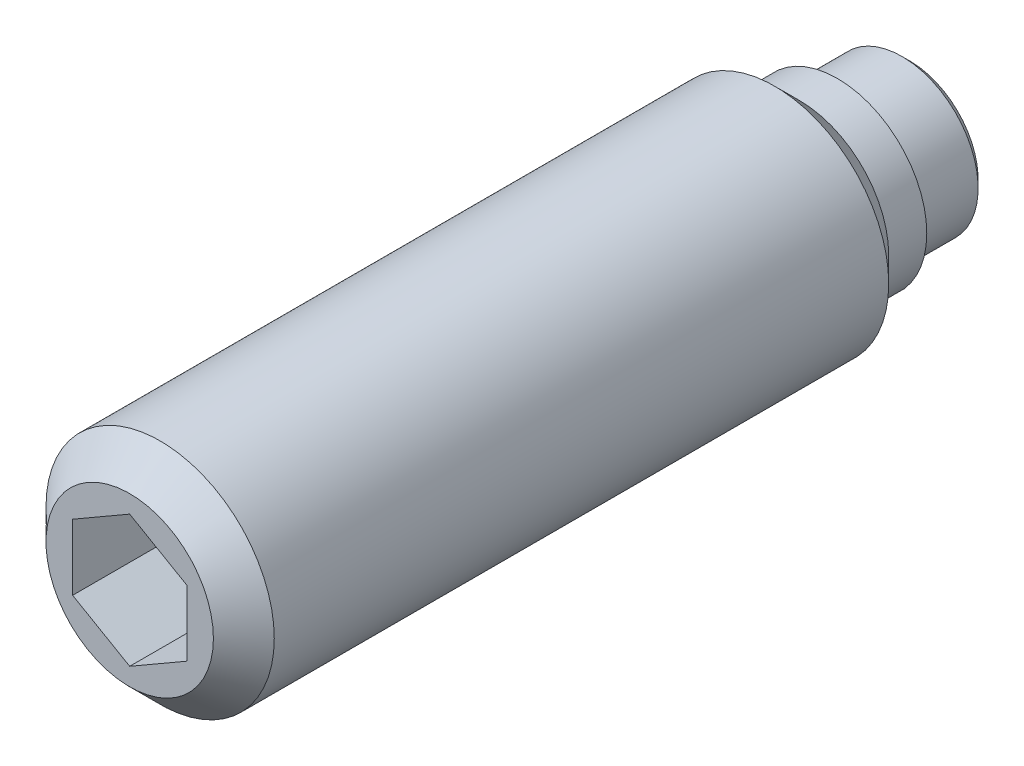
ISO-10303-21;
HEADER;
FILE_DESCRIPTION(('STEP AP214'),'2;1');
FILE_NAME('part.step','',(''),(''),'','','');
FILE_SCHEMA(('AUTOMOTIVE_DESIGN { 1 0 10303 214 1 1 1 1 }'));
ENDSEC;
DATA;
#1=APPLICATION_CONTEXT('core data for automotive mechanical design processes');
#2=APPLICATION_PROTOCOL_DEFINITION('international standard','automotive_design',2000,#1);
#3=PRODUCT_CONTEXT('',#1,'mechanical');
#4=PRODUCT('Part','Part','',(#3));
#5=PRODUCT_RELATED_PRODUCT_CATEGORY('part','',(#4));
#6=PRODUCT_DEFINITION_FORMATION('','',#4);
#7=PRODUCT_DEFINITION_CONTEXT('part definition',#1,'design');
#8=PRODUCT_DEFINITION('design','',#6,#7);
#9=PRODUCT_DEFINITION_SHAPE('','',#8);
#10=(LENGTH_UNIT() NAMED_UNIT(*) SI_UNIT(.MILLI.,.METRE.));
#11=(NAMED_UNIT(*) PLANE_ANGLE_UNIT() SI_UNIT($,.RADIAN.));
#12=(NAMED_UNIT(*) SI_UNIT($,.STERADIAN.) SOLID_ANGLE_UNIT());
#13=UNCERTAINTY_MEASURE_WITH_UNIT(LENGTH_MEASURE(1.E-05),#10,'distance_accuracy_value','');
#14=(GEOMETRIC_REPRESENTATION_CONTEXT(3) GLOBAL_UNCERTAINTY_ASSIGNED_CONTEXT((#13)) GLOBAL_UNIT_ASSIGNED_CONTEXT((#10,
#11,#12)) REPRESENTATION_CONTEXT('',''));
#15=CARTESIAN_POINT('',(0.,0.,0.));
#16=DIRECTION('',(0.,0.,1.));
#17=DIRECTION('',(1.,0.,0.));
#18=AXIS2_PLACEMENT_3D('',#15,#16,#17);
#19=CARTESIAN_POINT('',(0.,0.,1.9));
#20=DIRECTION('',(0.,0.,-1.));
#21=DIRECTION('',(-1.,0.,0.));
#22=AXIS2_PLACEMENT_3D('',#19,#20,#21);
#23=CYLINDRICAL_SURFACE('',#22,3.);
#24=CARTESIAN_POINT('',(0.,0.,19.7));
#25=DIRECTION('',(0.,0.,1.));
#26=DIRECTION('',(1.,0.,0.));
#27=AXIS2_PLACEMENT_3D('',#24,#25,#26);
#28=CIRCLE('',#27,3.);
#29=CARTESIAN_POINT('',(3.,0.,19.7));
#30=VERTEX_POINT('',#29);
#31=EDGE_CURVE('E9',#30,#30,#28,.F.);
#32=ORIENTED_EDGE('',*,*,#31,.T.);
#33=EDGE_LOOP('',(#32));
#34=FACE_BOUND('',#33,.T.);
#35=CARTESIAN_POINT('',(0.,0.,3.55));
#36=DIRECTION('',(0.,0.,-1.));
#37=DIRECTION('',(-1.,0.,0.));
#38=AXIS2_PLACEMENT_3D('',#35,#36,#37);
#39=CIRCLE('',#38,3.);
#40=CARTESIAN_POINT('',(-3.,0.,3.55));
#41=VERTEX_POINT('',#40);
#42=EDGE_CURVE('E74',#41,#41,#39,.T.);
#43=ORIENTED_EDGE('',*,*,#42,.F.);
#44=EDGE_LOOP('',(#43));
#45=FACE_BOUND('',#44,.T.);
#46=ADVANCED_FACE('F14',(#34,#45),#23,.T.);
#47=CARTESIAN_POINT('',(0.,0.,3.55));
#48=DIRECTION('',(0.,0.,1.));
#49=DIRECTION('',(1.,0.,0.));
#50=AXIS2_PLACEMENT_3D('',#47,#48,#49);
#51=CONICAL_SURFACE('',#50,3.,0.785398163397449);
#52=ORIENTED_EDGE('',*,*,#42,.T.);
#53=EDGE_LOOP('',(#52));
#54=FACE_BOUND('',#53,.T.);
#55=CARTESIAN_POINT('',(0.,0.,2.9));
#56=DIRECTION('',(0.,0.,-1.));
#57=DIRECTION('',(-1.,0.,0.));
#58=AXIS2_PLACEMENT_3D('',#55,#56,#57);
#59=CIRCLE('',#58,2.35);
#60=CARTESIAN_POINT('',(-2.35,0.,2.9));
#61=VERTEX_POINT('',#60);
#62=EDGE_CURVE('E112',#61,#61,#59,.T.);
#63=ORIENTED_EDGE('',*,*,#62,.F.);
#64=EDGE_LOOP('',(#63));
#65=FACE_BOUND('',#64,.T.);
#66=ADVANCED_FACE('F130',(#54,#65),#51,.T.);
#67=CARTESIAN_POINT('',(0.,0.,1.9));
#68=DIRECTION('',(0.,0.,-1.));
#69=DIRECTION('',(-1.,0.,0.));
#70=AXIS2_PLACEMENT_3D('',#67,#68,#69);
#71=CYLINDRICAL_SURFACE('',#70,2.35);
#72=ORIENTED_EDGE('',*,*,#62,.T.);
#73=EDGE_LOOP('',(#72));
#74=FACE_BOUND('',#73,.T.);
#75=CARTESIAN_POINT('',(0.,0.,1.9));
#76=DIRECTION('',(0.,0.,-1.));
#77=DIRECTION('',(-1.,0.,0.));
#78=AXIS2_PLACEMENT_3D('',#75,#76,#77);
#79=CIRCLE('',#78,2.35);
#80=CARTESIAN_POINT('',(-2.35,0.,1.9));
#81=VERTEX_POINT('',#80);
#82=EDGE_CURVE('E109',#81,#81,#79,.T.);
#83=ORIENTED_EDGE('',*,*,#82,.F.);
#84=EDGE_LOOP('',(#83));
#85=FACE_BOUND('',#84,.T.);
#86=ADVANCED_FACE('F135',(#74,#85),#71,.T.);
#87=CARTESIAN_POINT('',(0.,2.35,1.9));
#88=DIRECTION('',(0.,0.,1.));
#89=DIRECTION('',(1.,0.,0.));
#90=AXIS2_PLACEMENT_3D('',#87,#88,#89);
#91=PLANE('',#90);
#92=ORIENTED_EDGE('',*,*,#82,.T.);
#93=EDGE_LOOP('',(#92));
#94=FACE_BOUND('',#93,.T.);
#95=CARTESIAN_POINT('',(0.,0.,1.9));
#96=DIRECTION('',(0.,0.,-1.));
#97=DIRECTION('',(-1.,0.,0.));
#98=AXIS2_PLACEMENT_3D('',#95,#96,#97);
#99=CIRCLE('',#98,2.);
#100=CARTESIAN_POINT('',(-2.,0.,1.9));
#101=VERTEX_POINT('',#100);
#102=EDGE_CURVE('E106',#101,#101,#99,.T.);
#103=ORIENTED_EDGE('',*,*,#102,.F.);
#104=EDGE_LOOP('',(#103));
#105=FACE_BOUND('',#104,.T.);
#106=ADVANCED_FACE('F142',(#94,#105),#91,.F.);
#107=CARTESIAN_POINT('',(0.,0.,0.));
#108=DIRECTION('',(0.,0.,-1.));
#109=DIRECTION('',(-1.,0.,0.));
#110=AXIS2_PLACEMENT_3D('',#107,#108,#109);
#111=CYLINDRICAL_SURFACE('',#110,2.);
#112=CARTESIAN_POINT('',(0.,0.,0.2));
#113=DIRECTION('',(0.,0.,-1.));
#114=DIRECTION('',(-1.,0.,0.));
#115=AXIS2_PLACEMENT_3D('',#112,#113,#114);
#116=CIRCLE('',#115,2.);
#117=CARTESIAN_POINT('',(-2.,0.,0.2));
#118=VERTEX_POINT('',#117);
#119=EDGE_CURVE('E103',#118,#118,#116,.T.);
#120=ORIENTED_EDGE('',*,*,#119,.F.);
#121=EDGE_LOOP('',(#120));
#122=FACE_BOUND('',#121,.T.);
#123=ORIENTED_EDGE('',*,*,#102,.T.);
#124=EDGE_LOOP('',(#123));
#125=FACE_BOUND('',#124,.T.);
#126=ADVANCED_FACE('F146',(#122,#125),#111,.T.);
#127=CARTESIAN_POINT('',(0.,0.,0.2));
#128=DIRECTION('',(0.,0.,1.));
#129=DIRECTION('',(1.,0.,0.));
#130=AXIS2_PLACEMENT_3D('',#127,#128,#129);
#131=CONICAL_SURFACE('',#130,2.,0.785398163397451);
#132=CARTESIAN_POINT('',(0.,0.,0.));
#133=DIRECTION('',(0.,0.,-1.));
#134=DIRECTION('',(-1.,0.,0.));
#135=AXIS2_PLACEMENT_3D('',#132,#133,#134);
#136=CIRCLE('',#135,1.8);
#137=CARTESIAN_POINT('',(-1.8,0.,0.));
#138=VERTEX_POINT('',#137);
#139=EDGE_CURVE('E100',#138,#138,#136,.T.);
#140=ORIENTED_EDGE('',*,*,#139,.F.);
#141=EDGE_LOOP('',(#140));
#142=FACE_BOUND('',#141,.T.);
#143=ORIENTED_EDGE('',*,*,#119,.T.);
#144=EDGE_LOOP('',(#143));
#145=FACE_BOUND('',#144,.T.);
#146=ADVANCED_FACE('F150',(#142,#145),#131,.T.);
#147=CARTESIAN_POINT('',(0.,1.8,0.));
#148=DIRECTION('',(0.,0.,1.));
#149=DIRECTION('',(1.,0.,0.));
#150=AXIS2_PLACEMENT_3D('',#147,#148,#149);
#151=PLANE('',#150);
#152=ORIENTED_EDGE('',*,*,#139,.T.);
#153=EDGE_LOOP('',(#152));
#154=FACE_BOUND('',#153,.T.);
#155=ADVANCED_FACE('F154',(#154),#151,.F.);
#156=CARTESIAN_POINT('',(0.,0.,20.5));
#157=DIRECTION('',(0.,0.,1.));
#158=DIRECTION('',(1.,0.,0.));
#159=AXIS2_PLACEMENT_3D('',#156,#157,#158);
#160=PLANE('',#159);
#161=CARTESIAN_POINT('',(0.,0.,20.5));
#162=DIRECTION('',(0.,0.,1.));
#163=DIRECTION('',(1.,0.,0.));
#164=AXIS2_PLACEMENT_3D('',#161,#162,#163);
#165=CIRCLE('',#164,2.2);
#166=CARTESIAN_POINT('',(2.2,0.,20.5));
#167=VERTEX_POINT('',#166);
#168=EDGE_CURVE('E22',#167,#167,#165,.T.);
#169=ORIENTED_EDGE('',*,*,#168,.T.);
#170=EDGE_LOOP('',(#169));
#171=FACE_BOUND('',#170,.T.);
#172=DIRECTION('',(-0.866025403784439,0.5,0.));
#173=VECTOR('',#172,1.);
#174=CARTESIAN_POINT('',(-1.5,-0.866025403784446,20.5));
#175=LINE('',#174,#173);
#176=CARTESIAN_POINT('',(0.,-1.73205080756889,20.5));
#177=VERTEX_POINT('',#176);
#178=CARTESIAN_POINT('',(-1.5,-0.866025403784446,20.5));
#179=VERTEX_POINT('',#178);
#180=EDGE_CURVE('E69',#177,#179,#175,.T.);
#181=ORIENTED_EDGE('',*,*,#180,.T.);
#182=DIRECTION('',(0.,1.,0.));
#183=VECTOR('',#182,1.);
#184=CARTESIAN_POINT('',(-1.5,0.866025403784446,20.5));
#185=LINE('',#184,#183);
#186=CARTESIAN_POINT('',(-1.5,0.866025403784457,20.5));
#187=VERTEX_POINT('',#186);
#188=EDGE_CURVE('E84',#179,#187,#185,.T.);
#189=ORIENTED_EDGE('',*,*,#188,.T.);
#190=DIRECTION('',(0.866025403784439,0.5,0.));
#191=VECTOR('',#190,1.);
#192=CARTESIAN_POINT('',(0.,1.73205080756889,20.5));
#193=LINE('',#192,#191);
#194=CARTESIAN_POINT('',(0.,1.73205080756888,20.5));
#195=VERTEX_POINT('',#194);
#196=EDGE_CURVE('E301',#187,#195,#193,.T.);
#197=ORIENTED_EDGE('',*,*,#196,.T.);
#198=DIRECTION('',(0.866025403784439,-0.5,0.));
#199=VECTOR('',#198,1.);
#200=CARTESIAN_POINT('',(1.5,0.866025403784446,20.5));
#201=LINE('',#200,#199);
#202=CARTESIAN_POINT('',(1.5,0.866025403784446,20.5));
#203=VERTEX_POINT('',#202);
#204=EDGE_CURVE('E298',#195,#203,#201,.T.);
#205=ORIENTED_EDGE('',*,*,#204,.T.);
#206=DIRECTION('',(0.,-1.,0.));
#207=VECTOR('',#206,1.);
#208=CARTESIAN_POINT('',(1.5,-0.866025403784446,20.5));
#209=LINE('',#208,#207);
#210=CARTESIAN_POINT('',(1.5,-0.866025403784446,20.5));
#211=VERTEX_POINT('',#210);
#212=EDGE_CURVE('E29',#203,#211,#209,.T.);
#213=ORIENTED_EDGE('',*,*,#212,.T.);
#214=DIRECTION('',(-0.866025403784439,-0.5,0.));
#215=VECTOR('',#214,1.);
#216=CARTESIAN_POINT('',(0.,-1.73205080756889,20.5));
#217=LINE('',#216,#215);
#218=EDGE_CURVE('E66',#211,#177,#217,.T.);
#219=ORIENTED_EDGE('',*,*,#218,.T.);
#220=EDGE_LOOP('',(#181,#189,#197,#205,#213,#219));
#221=FACE_BOUND('',#220,.T.);
#222=ADVANCED_FACE('F68',(#171,#221),#160,.T.);
#223=CARTESIAN_POINT('',(0.,0.,17.));
#224=DIRECTION('',(0.,0.,1.));
#225=DIRECTION('',(1.,0.,0.));
#226=AXIS2_PLACEMENT_3D('',#223,#224,#225);
#227=PLANE('',#226);
#228=DIRECTION('',(0.,-1.,0.));
#229=VECTOR('',#228,1.);
#230=CARTESIAN_POINT('',(-1.5,0.866025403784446,17.));
#231=LINE('',#230,#229);
#232=CARTESIAN_POINT('',(-1.5,0.866025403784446,17.));
#233=VERTEX_POINT('',#232);
#234=CARTESIAN_POINT('',(-1.5,-0.866025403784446,17.));
#235=VERTEX_POINT('',#234);
#236=EDGE_CURVE('E83',#233,#235,#231,.T.);
#237=ORIENTED_EDGE('',*,*,#236,.T.);
#238=DIRECTION('',(0.866025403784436,-0.5,0.));
#239=VECTOR('',#238,1.);
#240=CARTESIAN_POINT('',(-1.5,-0.866025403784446,17.));
#241=LINE('',#240,#239);
#242=CARTESIAN_POINT('',(0.,-1.73205080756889,17.));
#243=VERTEX_POINT('',#242);
#244=EDGE_CURVE('E280',#235,#243,#241,.T.);
#245=ORIENTED_EDGE('',*,*,#244,.T.);
#246=DIRECTION('',(0.866025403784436,0.5,0.));
#247=VECTOR('',#246,1.);
#248=CARTESIAN_POINT('',(0.,-1.73205080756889,17.));
#249=LINE('',#248,#247);
#250=CARTESIAN_POINT('',(1.5,-0.866025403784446,17.));
#251=VERTEX_POINT('',#250);
#252=EDGE_CURVE('E88',#243,#251,#249,.T.);
#253=ORIENTED_EDGE('',*,*,#252,.T.);
#254=DIRECTION('',(0.,1.,0.));
#255=VECTOR('',#254,1.);
#256=CARTESIAN_POINT('',(1.5,-0.866025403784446,17.));
#257=LINE('',#256,#255);
#258=CARTESIAN_POINT('',(1.5,0.866025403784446,17.));
#259=VERTEX_POINT('',#258);
#260=EDGE_CURVE('E287',#251,#259,#257,.T.);
#261=ORIENTED_EDGE('',*,*,#260,.T.);
#262=DIRECTION('',(-0.866025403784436,0.5,0.));
#263=VECTOR('',#262,1.);
#264=CARTESIAN_POINT('',(1.5,0.866025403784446,17.));
#265=LINE('',#264,#263);
#266=CARTESIAN_POINT('',(0.,1.73205080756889,17.));
#267=VERTEX_POINT('',#266);
#268=EDGE_CURVE('E96',#259,#267,#265,.T.);
#269=ORIENTED_EDGE('',*,*,#268,.T.);
#270=DIRECTION('',(-0.866025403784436,-0.5,0.));
#271=VECTOR('',#270,1.);
#272=CARTESIAN_POINT('',(0.,1.73205080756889,17.));
#273=LINE('',#272,#271);
#274=EDGE_CURVE('E91',#267,#233,#273,.T.);
#275=ORIENTED_EDGE('',*,*,#274,.T.);
#276=EDGE_LOOP('',(#237,#245,#253,#261,#269,#275));
#277=FACE_BOUND('',#276,.T.);
#278=ADVANCED_FACE('F162',(#277),#227,.T.);
#279=CARTESIAN_POINT('',(0.,-1.73205080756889,23.));
#280=DIRECTION('',(0.5,-0.866025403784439,0.));
#281=DIRECTION('',(0.866025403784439,0.5,0.));
#282=AXIS2_PLACEMENT_3D('',#279,#280,#281);
#283=PLANE('',#282);
#284=ORIENTED_EDGE('',*,*,#218,.F.);
#285=DIRECTION('',(0.,0.,1.));
#286=VECTOR('',#285,1.);
#287=CARTESIAN_POINT('',(1.5,-0.866025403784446,23.));
#288=LINE('',#287,#286);
#289=EDGE_CURVE('E90',#251,#211,#288,.T.);
#290=ORIENTED_EDGE('',*,*,#289,.F.);
#291=ORIENTED_EDGE('',*,*,#252,.F.);
#292=DIRECTION('',(0.,0.,1.));
#293=VECTOR('',#292,1.);
#294=CARTESIAN_POINT('',(0.,-1.73205080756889,23.));
#295=LINE('',#294,#293);
#296=EDGE_CURVE('E80',#243,#177,#295,.T.);
#297=ORIENTED_EDGE('',*,*,#296,.T.);
#298=EDGE_LOOP('',(#284,#290,#291,#297));
#299=FACE_BOUND('',#298,.T.);
#300=ADVANCED_FACE('F86',(#299),#283,.F.);
#301=CARTESIAN_POINT('',(1.5,-0.866025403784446,23.));
#302=DIRECTION('',(1.,0.,0.));
#303=DIRECTION('',(0.,0.,-1.));
#304=AXIS2_PLACEMENT_3D('',#301,#302,#303);
#305=PLANE('',#304);
#306=ORIENTED_EDGE('',*,*,#212,.F.);
#307=DIRECTION('',(0.,0.,1.));
#308=VECTOR('',#307,1.);
#309=CARTESIAN_POINT('',(1.5,0.866025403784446,23.));
#310=LINE('',#309,#308);
#311=EDGE_CURVE('E93',#259,#203,#310,.T.);
#312=ORIENTED_EDGE('',*,*,#311,.F.);
#313=ORIENTED_EDGE('',*,*,#260,.F.);
#314=ORIENTED_EDGE('',*,*,#289,.T.);
#315=EDGE_LOOP('',(#306,#312,#313,#314));
#316=FACE_BOUND('',#315,.T.);
#317=ADVANCED_FACE('F161',(#316),#305,.F.);
#318=CARTESIAN_POINT('',(1.5,0.866025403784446,23.));
#319=DIRECTION('',(0.5,0.866025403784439,0.));
#320=DIRECTION('',(-0.866025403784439,0.5,0.));
#321=AXIS2_PLACEMENT_3D('',#318,#319,#320);
#322=PLANE('',#321);
#323=ORIENTED_EDGE('',*,*,#204,.F.);
#324=DIRECTION('',(0.,0.,1.));
#325=VECTOR('',#324,1.);
#326=CARTESIAN_POINT('',(0.,1.73205080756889,23.));
#327=LINE('',#326,#325);
#328=EDGE_CURVE('E293',#267,#195,#327,.T.);
#329=ORIENTED_EDGE('',*,*,#328,.F.);
#330=ORIENTED_EDGE('',*,*,#268,.F.);
#331=ORIENTED_EDGE('',*,*,#311,.T.);
#332=EDGE_LOOP('',(#323,#329,#330,#331));
#333=FACE_BOUND('',#332,.T.);
#334=ADVANCED_FACE('F165',(#333),#322,.F.);
#335=CARTESIAN_POINT('',(0.,1.73205080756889,23.));
#336=DIRECTION('',(-0.5,0.866025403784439,0.));
#337=DIRECTION('',(-0.866025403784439,-0.5,0.));
#338=AXIS2_PLACEMENT_3D('',#335,#336,#337);
#339=PLANE('',#338);
#340=ORIENTED_EDGE('',*,*,#196,.F.);
#341=DIRECTION('',(0.,0.,1.));
#342=VECTOR('',#341,1.);
#343=CARTESIAN_POINT('',(-1.5,0.866025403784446,23.));
#344=LINE('',#343,#342);
#345=EDGE_CURVE('E37',#233,#187,#344,.T.);
#346=ORIENTED_EDGE('',*,*,#345,.F.);
#347=ORIENTED_EDGE('',*,*,#274,.F.);
#348=ORIENTED_EDGE('',*,*,#328,.T.);
#349=EDGE_LOOP('',(#340,#346,#347,#348));
#350=FACE_BOUND('',#349,.T.);
#351=ADVANCED_FACE('F169',(#350),#339,.F.);
#352=CARTESIAN_POINT('',(-1.5,0.866025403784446,23.));
#353=DIRECTION('',(-1.,0.,0.));
#354=DIRECTION('',(0.,0.,1.));
#355=AXIS2_PLACEMENT_3D('',#352,#353,#354);
#356=PLANE('',#355);
#357=ORIENTED_EDGE('',*,*,#188,.F.);
#358=DIRECTION('',(0.,0.,1.));
#359=VECTOR('',#358,1.);
#360=CARTESIAN_POINT('',(-1.5,-0.866025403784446,23.));
#361=LINE('',#360,#359);
#362=EDGE_CURVE('E82',#235,#179,#361,.T.);
#363=ORIENTED_EDGE('',*,*,#362,.F.);
#364=ORIENTED_EDGE('',*,*,#236,.F.);
#365=ORIENTED_EDGE('',*,*,#345,.T.);
#366=EDGE_LOOP('',(#357,#363,#364,#365));
#367=FACE_BOUND('',#366,.T.);
#368=ADVANCED_FACE('F126',(#367),#356,.F.);
#369=CARTESIAN_POINT('',(-1.5,-0.866025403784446,23.));
#370=DIRECTION('',(-0.5,-0.866025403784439,0.));
#371=DIRECTION('',(0.866025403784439,-0.5,0.));
#372=AXIS2_PLACEMENT_3D('',#369,#370,#371);
#373=PLANE('',#372);
#374=ORIENTED_EDGE('',*,*,#180,.F.);
#375=ORIENTED_EDGE('',*,*,#296,.F.);
#376=ORIENTED_EDGE('',*,*,#244,.F.);
#377=ORIENTED_EDGE('',*,*,#362,.T.);
#378=EDGE_LOOP('',(#374,#375,#376,#377));
#379=FACE_BOUND('',#378,.T.);
#380=ADVANCED_FACE('F78',(#379),#373,.F.);
#381=CARTESIAN_POINT('',(0.,0.,20.5));
#382=DIRECTION('',(0.,0.,-1.));
#383=DIRECTION('',(-1.,0.,0.));
#384=AXIS2_PLACEMENT_3D('',#381,#382,#383);
#385=CONICAL_SURFACE('',#384,2.2,0.785398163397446);
#386=ORIENTED_EDGE('',*,*,#31,.F.);
#387=EDGE_LOOP('',(#386));
#388=FACE_BOUND('',#387,.T.);
#389=ORIENTED_EDGE('',*,*,#168,.F.);
#390=EDGE_LOOP('',(#389));
#391=FACE_BOUND('',#390,.T.);
#392=ADVANCED_FACE('F16',(#388,#391),#385,.T.);
#393=CLOSED_SHELL('',(#46,#66,#86,#106,#126,#146,#155,#222,#278,#300,#317,#334,#351,#368,#380,#392));
#394=MANIFOLD_SOLID_BREP('B1',#393);
#395=ADVANCED_BREP_SHAPE_REPRESENTATION('',(#18,#394),#14);
#396=SHAPE_DEFINITION_REPRESENTATION(#9,#395);
ENDSEC;
END-ISO-10303-21;
